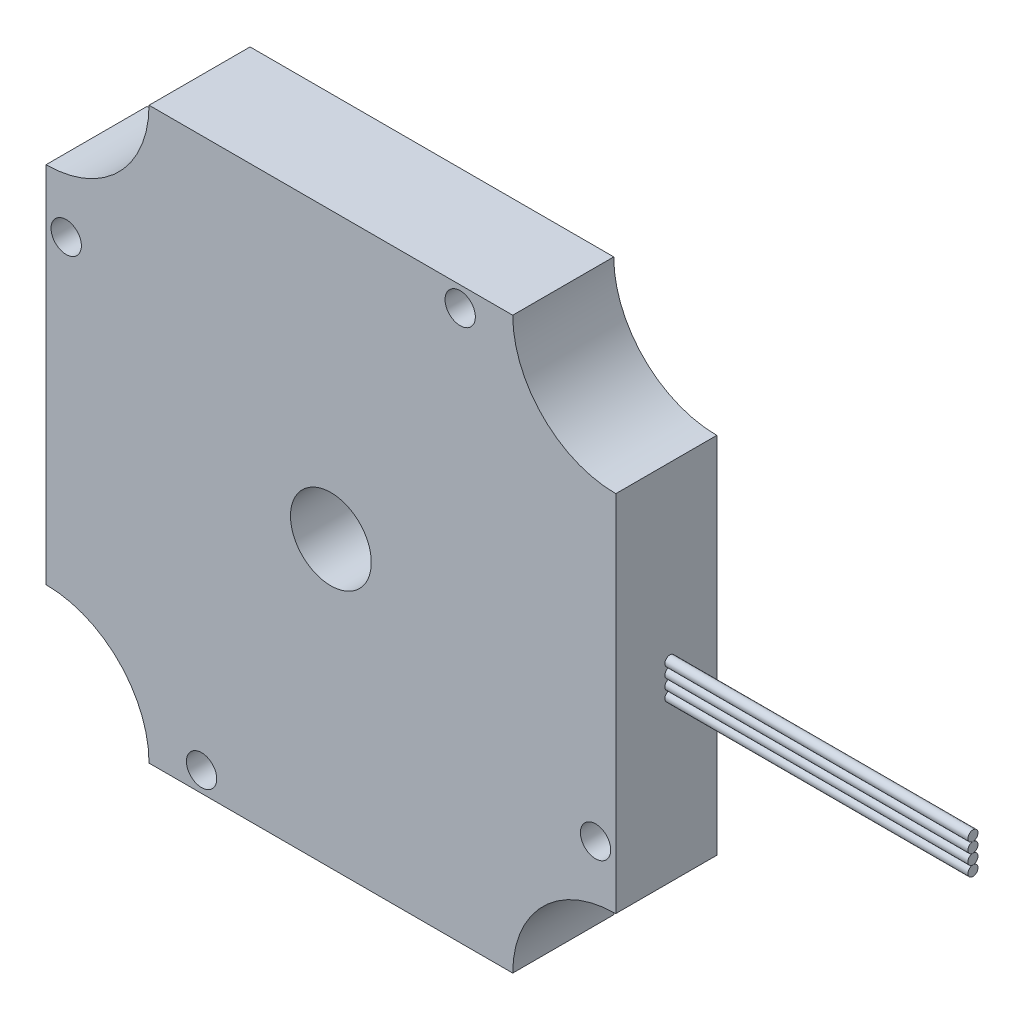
from build123d import *

# Parameters (mm, degrees)
EXTRUDE_1_DEPTH          = 10
SKETCH_2_R               = 4
CUT_EXTRUDE_1_DEPTH      = 10
SKETCH_3_R               = 0.5
EXTRUDE_2_DEPTH          = 30
EXTRUDE_2_2_DEPTH        = 30
EXTRUDE_2_3_DEPTH        = 30
EXTRUDE_2_4_DEPTH        = 30
SKETCH_4_R               = 1.5
CUT_EXTRUDE_2_DEPTH      = 50
PATTERN_CIRCULAR_1_COUNT = 4


with BuildPart() as part:
    # Sketch 1 → Extrude 1 (new body)
    with BuildSketch(Plane.XY):
        with BuildLine():
            Line((-18, -28.2), (18, -28.2))
            ThreePointArc((18, -28.2), (20.987510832, -20.987510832), (28.2, -18))
            Line((28.2, -18), (28.2, 18))
            ThreePointArc((28.2, 18), (20.987510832, 20.987510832), (18, 28.2))
            Line((18, 28.2), (-18, 28.2))
            ThreePointArc((-18, 28.2), (-20.987510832, 20.987510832), (-28.2, 18))
            Line((-28.2, 18), (-28.2, -18))
            ThreePointArc((-28.2, -18), (-20.987510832, -20.987510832), (-18, -28.2))
        make_face()
    extrude(amount=EXTRUDE_1_DEPTH)

    # Sketch 2 → Cut-Extrude 1 (cut)
    with BuildSketch(Plane(origin=(0, 0, 0), x_dir=(-1, 0, 0), z_dir=(0, 0, -1))):
        Circle(SKETCH_2_R)
    extrude(amount=-CUT_EXTRUDE_1_DEPTH, mode=Mode.SUBTRACT)

    # Sketch 4 → Cut-Extrude 2 (cut)
    with BuildSketch(Plane(origin=(0, 0, 0), x_dir=(-1, 0, 0), z_dir=(0, 0, -1))):
        with Locations((-12.8, 26.2)):
            Circle(SKETCH_4_R)
    cut_extrude_2 = extrude(amount=-CUT_EXTRUDE_2_DEPTH, mode=Mode.SUBTRACT)

    # Pattern Circular 1: Cut-Extrude 2 ×4 about axis
    pattern_circular_1_axis = Axis((0, 0, 0), (0, 0, 1))
    for i in range(1, PATTERN_CIRCULAR_1_COUNT):
        add(cut_extrude_2.rotate(pattern_circular_1_axis, i * 360 / PATTERN_CIRCULAR_1_COUNT), mode=Mode.SUBTRACT)


with BuildPart() as body_2:
    # Sketch 3 → Extrude 2 (new body)
    with BuildSketch(Plane(origin=(28.2, 0, 0), x_dir=(0, 0, -1), z_dir=(1, 0, 0))):
        with Locations((-4.643448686, 0)):
            Circle(SKETCH_3_R)
    extrude(amount=EXTRUDE_2_DEPTH)


with BuildPart() as body_3:
    # Sketch 3 → Extrude 2 2 (new body)
    with BuildSketch(Plane(origin=(28.2, 0, 0), x_dir=(0, 0, -1), z_dir=(1, 0, 0))):
        with Locations((-4.643448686, 1)):
            Circle(SKETCH_3_R)
    extrude(amount=EXTRUDE_2_2_DEPTH)


with BuildPart() as body_4:
    # Sketch 3 → Extrude 2 3 (new body)
    with BuildSketch(Plane(origin=(28.2, 0, 0), x_dir=(0, 0, -1), z_dir=(1, 0, 0))):
        with Locations((-4.643448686, -1)):
            Circle(SKETCH_3_R)
    extrude(amount=EXTRUDE_2_3_DEPTH)


with BuildPart() as body_5:
    # Sketch 3 → Extrude 2 4 (new body)
    with BuildSketch(Plane(origin=(28.2, 0, 0), x_dir=(0, 0, -1), z_dir=(1, 0, 0))):
        with Locations((-4.643448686, -2)):
            Circle(SKETCH_3_R)
    extrude(amount=EXTRUDE_2_4_DEPTH)


solid = Compound([part.part, body_2.part, body_3.part, body_4.part, body_5.part])
